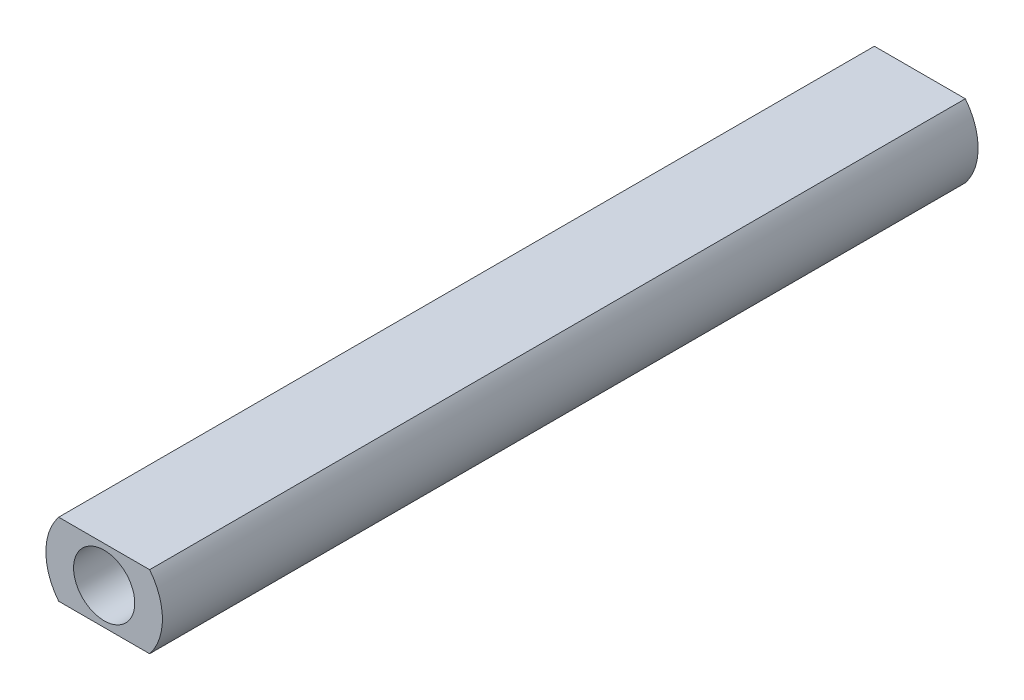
ISO-10303-21;
HEADER;
FILE_DESCRIPTION(('STEP AP214'),'2;1');
FILE_NAME('part.step','',(''),(''),'','','');
FILE_SCHEMA(('AUTOMOTIVE_DESIGN { 1 0 10303 214 1 1 1 1 }'));
ENDSEC;
DATA;
#1=APPLICATION_CONTEXT('core data for automotive mechanical design processes');
#2=APPLICATION_PROTOCOL_DEFINITION('international standard','automotive_design',2000,#1);
#3=PRODUCT_CONTEXT('',#1,'mechanical');
#4=PRODUCT('Part','Part','',(#3));
#5=PRODUCT_RELATED_PRODUCT_CATEGORY('part','',(#4));
#6=PRODUCT_DEFINITION_FORMATION('','',#4);
#7=PRODUCT_DEFINITION_CONTEXT('part definition',#1,'design');
#8=PRODUCT_DEFINITION('design','',#6,#7);
#9=PRODUCT_DEFINITION_SHAPE('','',#8);
#10=(LENGTH_UNIT() NAMED_UNIT(*) SI_UNIT(.MILLI.,.METRE.));
#11=(NAMED_UNIT(*) PLANE_ANGLE_UNIT() SI_UNIT($,.RADIAN.));
#12=(NAMED_UNIT(*) SI_UNIT($,.STERADIAN.) SOLID_ANGLE_UNIT());
#13=UNCERTAINTY_MEASURE_WITH_UNIT(LENGTH_MEASURE(1.E-05),#10,'distance_accuracy_value','');
#14=(GEOMETRIC_REPRESENTATION_CONTEXT(3) GLOBAL_UNCERTAINTY_ASSIGNED_CONTEXT((#13)) GLOBAL_UNIT_ASSIGNED_CONTEXT((#10,
#11,#12)) REPRESENTATION_CONTEXT('',''));
#15=CARTESIAN_POINT('',(0.,0.,0.));
#16=DIRECTION('',(0.,0.,1.));
#17=DIRECTION('',(1.,0.,0.));
#18=AXIS2_PLACEMENT_3D('',#15,#16,#17);
#19=CARTESIAN_POINT('',(0.,0.,28.));
#20=DIRECTION('',(0.,0.,-1.));
#21=DIRECTION('',(-1.,0.,0.));
#22=AXIS2_PLACEMENT_3D('',#19,#20,#21);
#23=CYLINDRICAL_SURFACE('',#22,4.);
#24=DIRECTION('',(0.,0.,-1.));
#25=VECTOR('',#24,1.);
#26=CARTESIAN_POINT('',(-3.1224989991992,-2.5,28.));
#27=LINE('',#26,#25);
#28=CARTESIAN_POINT('',(-3.1224989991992,-2.5,28.));
#29=VERTEX_POINT('',#28);
#30=CARTESIAN_POINT('',(-3.1224989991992,-2.5,-28.));
#31=VERTEX_POINT('',#30);
#32=EDGE_CURVE('E83',#29,#31,#27,.T.);
#33=ORIENTED_EDGE('',*,*,#32,.F.);
#34=CARTESIAN_POINT('',(0.,0.,28.));
#35=DIRECTION('',(0.,0.,1.));
#36=DIRECTION('',(1.,0.,0.));
#37=AXIS2_PLACEMENT_3D('',#34,#35,#36);
#38=CIRCLE('',#37,4.);
#39=CARTESIAN_POINT('',(-3.1224989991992,2.5,28.));
#40=VERTEX_POINT('',#39);
#41=EDGE_CURVE('E11',#40,#29,#38,.T.);
#42=ORIENTED_EDGE('',*,*,#41,.F.);
#43=DIRECTION('',(0.,0.,-1.));
#44=VECTOR('',#43,1.);
#45=CARTESIAN_POINT('',(-3.1224989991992,2.5,28.));
#46=LINE('',#45,#44);
#47=CARTESIAN_POINT('',(-3.1224989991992,2.5,-28.));
#48=VERTEX_POINT('',#47);
#49=EDGE_CURVE('E110',#48,#40,#46,.F.);
#50=ORIENTED_EDGE('',*,*,#49,.F.);
#51=CARTESIAN_POINT('',(0.,0.,-28.));
#52=DIRECTION('',(0.,0.,1.));
#53=DIRECTION('',(1.,0.,0.));
#54=AXIS2_PLACEMENT_3D('',#51,#52,#53);
#55=CIRCLE('',#54,4.);
#56=EDGE_CURVE('E98',#48,#31,#55,.T.);
#57=ORIENTED_EDGE('',*,*,#56,.T.);
#58=EDGE_LOOP('',(#33,#42,#50,#57));
#59=FACE_BOUND('',#58,.T.);
#60=ADVANCED_FACE('F33',(#59),#23,.T.);
#61=DIRECTION('',(0.,0.,-1.));
#62=VECTOR('',#61,1.);
#63=CARTESIAN_POINT('',(3.1224989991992,-2.5,28.));
#64=LINE('',#63,#62);
#65=CARTESIAN_POINT('',(3.1224989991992,-2.5,-28.));
#66=VERTEX_POINT('',#65);
#67=CARTESIAN_POINT('',(3.1224989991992,-2.5,28.));
#68=VERTEX_POINT('',#67);
#69=EDGE_CURVE('E76',#66,#68,#64,.F.);
#70=ORIENTED_EDGE('',*,*,#69,.F.);
#71=CARTESIAN_POINT('',(3.1224989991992,2.5,-28.));
#72=VERTEX_POINT('',#71);
#73=EDGE_CURVE('E81',#66,#72,#55,.T.);
#74=ORIENTED_EDGE('',*,*,#73,.T.);
#75=DIRECTION('',(0.,0.,-1.));
#76=VECTOR('',#75,1.);
#77=CARTESIAN_POINT('',(3.1224989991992,2.5,28.));
#78=LINE('',#77,#76);
#79=CARTESIAN_POINT('',(3.1224989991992,2.5,28.));
#80=VERTEX_POINT('',#79);
#81=EDGE_CURVE('E112',#80,#72,#78,.T.);
#82=ORIENTED_EDGE('',*,*,#81,.F.);
#83=EDGE_CURVE('E40',#68,#80,#38,.T.);
#84=ORIENTED_EDGE('',*,*,#83,.F.);
#85=EDGE_LOOP('',(#70,#74,#82,#84));
#86=FACE_BOUND('',#85,.T.);
#87=ADVANCED_FACE('F78',(#86),#23,.T.);
#88=CARTESIAN_POINT('',(0.,0.,28.));
#89=DIRECTION('',(0.,0.,1.));
#90=DIRECTION('',(1.,0.,0.));
#91=AXIS2_PLACEMENT_3D('',#88,#89,#90);
#92=PLANE('',#91);
#93=CARTESIAN_POINT('',(0.,0.,28.));
#94=DIRECTION('',(0.,0.,1.));
#95=DIRECTION('',(1.,0.,0.));
#96=AXIS2_PLACEMENT_3D('',#93,#94,#95);
#97=CIRCLE('',#96,2.1);
#98=CARTESIAN_POINT('',(2.1,0.,28.));
#99=VERTEX_POINT('',#98);
#100=EDGE_CURVE('E116',#99,#99,#97,.T.);
#101=ORIENTED_EDGE('',*,*,#100,.F.);
#102=EDGE_LOOP('',(#101));
#103=FACE_BOUND('',#102,.T.);
#104=ORIENTED_EDGE('',*,*,#41,.T.);
#105=DIRECTION('',(-1.,0.,0.));
#106=VECTOR('',#105,1.);
#107=CARTESIAN_POINT('',(-4.18971606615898,-2.5,28.));
#108=LINE('',#107,#106);
#109=EDGE_CURVE('E84',#68,#29,#108,.T.);
#110=ORIENTED_EDGE('',*,*,#109,.F.);
#111=ORIENTED_EDGE('',*,*,#83,.T.);
#112=DIRECTION('',(1.,0.,0.));
#113=VECTOR('',#112,1.);
#114=CARTESIAN_POINT('',(-5.16613831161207,2.5,28.));
#115=LINE('',#114,#113);
#116=EDGE_CURVE('E108',#40,#80,#115,.T.);
#117=ORIENTED_EDGE('',*,*,#116,.F.);
#118=EDGE_LOOP('',(#104,#110,#111,#117));
#119=FACE_BOUND('',#118,.T.);
#120=ADVANCED_FACE('F122',(#103,#119),#92,.T.);
#121=CARTESIAN_POINT('',(0.,0.,28.));
#122=DIRECTION('',(0.,0.,1.));
#123=DIRECTION('',(1.,0.,0.));
#124=AXIS2_PLACEMENT_3D('',#121,#122,#123);
#125=CYLINDRICAL_SURFACE('',#124,2.1);
#126=CARTESIAN_POINT('',(0.,0.,13.6));
#127=DIRECTION('',(0.,0.,1.));
#128=DIRECTION('',(1.,0.,0.));
#129=AXIS2_PLACEMENT_3D('',#126,#127,#128);
#130=CIRCLE('',#129,2.1);
#131=CARTESIAN_POINT('',(2.1,0.,13.6));
#132=VERTEX_POINT('',#131);
#133=EDGE_CURVE('E114',#132,#132,#130,.T.);
#134=ORIENTED_EDGE('',*,*,#133,.F.);
#135=EDGE_LOOP('',(#134));
#136=FACE_BOUND('',#135,.T.);
#137=ORIENTED_EDGE('',*,*,#100,.T.);
#138=EDGE_LOOP('',(#137));
#139=FACE_BOUND('',#138,.T.);
#140=ADVANCED_FACE('F120',(#136,#139),#125,.F.);
#141=CARTESIAN_POINT('',(0.,0.,13.6));
#142=DIRECTION('',(0.,0.,1.));
#143=DIRECTION('',(1.,0.,0.));
#144=AXIS2_PLACEMENT_3D('',#141,#142,#143);
#145=CONICAL_SURFACE('',#144,2.1,1.02974425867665);
#146=CARTESIAN_POINT('',(0.,0.,12.3381927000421));
#147=VERTEX_POINT('',#146);
#148=VERTEX_LOOP('',#147);
#149=FACE_BOUND('',#148,.T.);
#150=ORIENTED_EDGE('',*,*,#133,.T.);
#151=EDGE_LOOP('',(#150));
#152=FACE_BOUND('',#151,.T.);
#153=ADVANCED_FACE('F163',(#149,#152),#145,.F.);
#154=CARTESIAN_POINT('',(-5.16613831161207,2.5,28.));
#155=DIRECTION('',(0.,1.,0.));
#156=DIRECTION('',(0.,0.,1.));
#157=AXIS2_PLACEMENT_3D('',#154,#155,#156);
#158=PLANE('',#157);
#159=ORIENTED_EDGE('',*,*,#81,.T.);
#160=DIRECTION('',(1.,0.,0.));
#161=VECTOR('',#160,1.);
#162=CARTESIAN_POINT('',(-5.16613831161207,2.5,-28.));
#163=LINE('',#162,#161);
#164=EDGE_CURVE('E93',#48,#72,#163,.T.);
#165=ORIENTED_EDGE('',*,*,#164,.F.);
#166=ORIENTED_EDGE('',*,*,#49,.T.);
#167=ORIENTED_EDGE('',*,*,#116,.T.);
#168=EDGE_LOOP('',(#159,#165,#166,#167));
#169=FACE_BOUND('',#168,.T.);
#170=ADVANCED_FACE('F127',(#169),#158,.T.);
#171=CARTESIAN_POINT('',(-4.18971606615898,-2.5,28.));
#172=DIRECTION('',(0.,-1.,0.));
#173=DIRECTION('',(1.,0.,0.));
#174=AXIS2_PLACEMENT_3D('',#171,#172,#173);
#175=PLANE('',#174);
#176=ORIENTED_EDGE('',*,*,#32,.T.);
#177=DIRECTION('',(-1.,0.,0.));
#178=VECTOR('',#177,1.);
#179=CARTESIAN_POINT('',(-4.18971606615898,-2.5,-28.));
#180=LINE('',#179,#178);
#181=EDGE_CURVE('E87',#66,#31,#180,.T.);
#182=ORIENTED_EDGE('',*,*,#181,.F.);
#183=ORIENTED_EDGE('',*,*,#69,.T.);
#184=ORIENTED_EDGE('',*,*,#109,.T.);
#185=EDGE_LOOP('',(#176,#182,#183,#184));
#186=FACE_BOUND('',#185,.T.);
#187=ADVANCED_FACE('F88',(#186),#175,.T.);
#188=CARTESIAN_POINT('',(0.,0.,-28.));
#189=DIRECTION('',(0.,0.,-1.));
#190=DIRECTION('',(1.,0.,0.));
#191=AXIS2_PLACEMENT_3D('',#188,#189,#190);
#192=PLANE('',#191);
#193=CARTESIAN_POINT('',(0.,0.,-28.));
#194=DIRECTION('',(0.,0.,1.));
#195=DIRECTION('',(1.,0.,0.));
#196=AXIS2_PLACEMENT_3D('',#193,#194,#195);
#197=CIRCLE('',#196,2.1);
#198=CARTESIAN_POINT('',(2.1,0.,-28.));
#199=VERTEX_POINT('',#198);
#200=EDGE_CURVE('E99',#199,#199,#197,.T.);
#201=ORIENTED_EDGE('',*,*,#200,.T.);
#202=EDGE_LOOP('',(#201));
#203=FACE_BOUND('',#202,.T.);
#204=ORIENTED_EDGE('',*,*,#56,.F.);
#205=ORIENTED_EDGE('',*,*,#164,.T.);
#206=ORIENTED_EDGE('',*,*,#73,.F.);
#207=ORIENTED_EDGE('',*,*,#181,.T.);
#208=EDGE_LOOP('',(#204,#205,#206,#207));
#209=FACE_BOUND('',#208,.T.);
#210=ADVANCED_FACE('F96',(#203,#209),#192,.T.);
#211=CARTESIAN_POINT('',(0.,0.,-28.));
#212=DIRECTION('',(0.,0.,-1.));
#213=DIRECTION('',(1.,0.,0.));
#214=AXIS2_PLACEMENT_3D('',#211,#212,#213);
#215=CYLINDRICAL_SURFACE('',#214,2.1);
#216=CARTESIAN_POINT('',(0.,0.,-13.6));
#217=DIRECTION('',(0.,0.,1.));
#218=DIRECTION('',(1.,0.,0.));
#219=AXIS2_PLACEMENT_3D('',#216,#217,#218);
#220=CIRCLE('',#219,2.1);
#221=CARTESIAN_POINT('',(2.1,0.,-13.6));
#222=VERTEX_POINT('',#221);
#223=EDGE_CURVE('E102',#222,#222,#220,.T.);
#224=ORIENTED_EDGE('',*,*,#223,.T.);
#225=EDGE_LOOP('',(#224));
#226=FACE_BOUND('',#225,.T.);
#227=ORIENTED_EDGE('',*,*,#200,.F.);
#228=EDGE_LOOP('',(#227));
#229=FACE_BOUND('',#228,.T.);
#230=ADVANCED_FACE('F132',(#226,#229),#215,.F.);
#231=CARTESIAN_POINT('',(0.,0.,-13.6));
#232=DIRECTION('',(0.,0.,-1.));
#233=DIRECTION('',(1.,0.,0.));
#234=AXIS2_PLACEMENT_3D('',#231,#232,#233);
#235=CONICAL_SURFACE('',#234,2.1,1.02974425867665);
#236=CARTESIAN_POINT('',(0.,0.,-12.3381927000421));
#237=VERTEX_POINT('',#236);
#238=VERTEX_LOOP('',#237);
#239=FACE_BOUND('',#238,.T.);
#240=ORIENTED_EDGE('',*,*,#223,.F.);
#241=EDGE_LOOP('',(#240));
#242=FACE_BOUND('',#241,.T.);
#243=ADVANCED_FACE('F135',(#239,#242),#235,.F.);
#244=CLOSED_SHELL('',(#60,#87,#120,#140,#153,#170,#187,#210,#230,#243));
#245=MANIFOLD_SOLID_BREP('B2',#244);
#246=ADVANCED_BREP_SHAPE_REPRESENTATION('',(#18,#245),#14);
#247=SHAPE_DEFINITION_REPRESENTATION(#9,#246);
ENDSEC;
END-ISO-10303-21;
